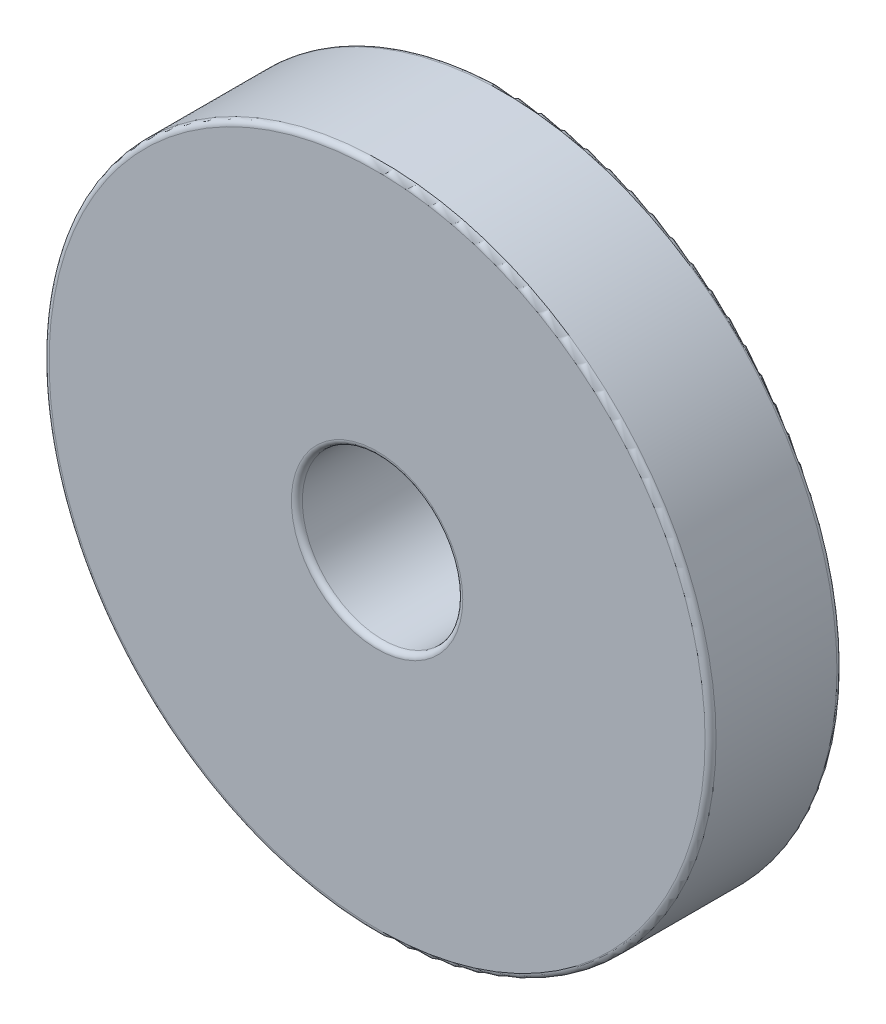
from build123d import *

# Parameters (mm, degrees)
SKETCH1_R      = 7.7089
SKETCH1_R_2    = 1.8542
EXTRUDE1_DEPTH = 3.048
FILLET1_R      = 0.127


with BuildPart() as part:
    # Sketch1 → Extrude1 (new body)
    with BuildSketch(Plane.XY):
        Circle(SKETCH1_R)
        Circle(SKETCH1_R_2, mode=Mode.SUBTRACT)
    extrude(amount=-EXTRUDE1_DEPTH)

    # Fillet1
    fillet1_edges = [part.edges().sort_by_distance(p)[0] for p in [
        (-7.7089, 0, 0),
        (-7.7089, 0, -3.048),
        (-1.8542, 0, -3.048),
        (-1.8542, 0, 0),
    ]]
    fillet(fillet1_edges, radius=FILLET1_R)


solid = part.part
